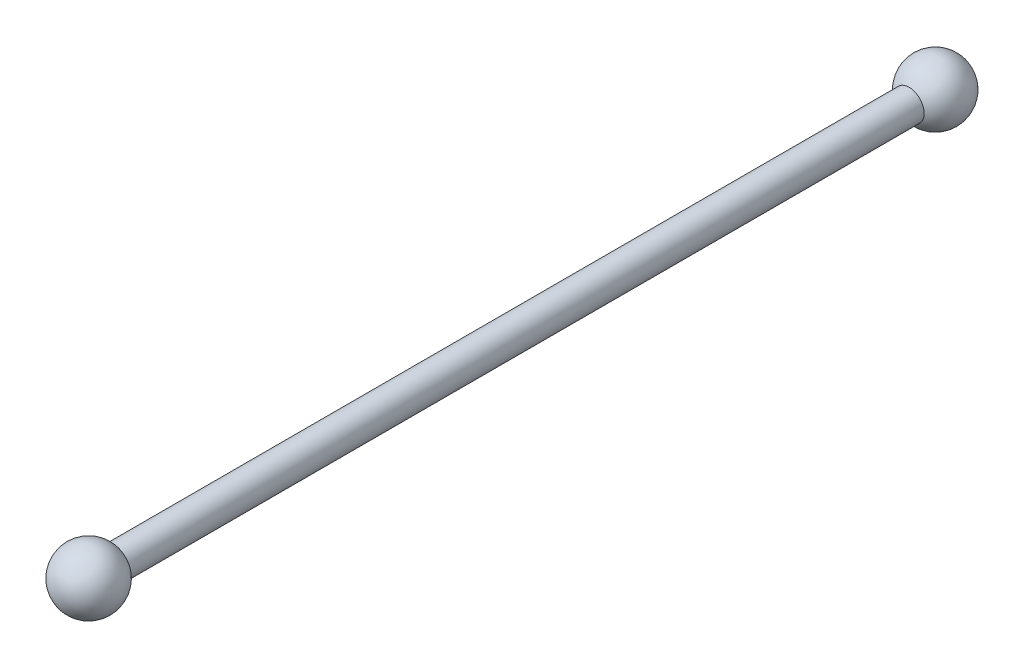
ISO-10303-21;
HEADER;
FILE_DESCRIPTION(('STEP AP214'),'2;1');
FILE_NAME('part.step','',(''),(''),'','','');
FILE_SCHEMA(('AUTOMOTIVE_DESIGN { 1 0 10303 214 1 1 1 1 }'));
ENDSEC;
DATA;
#1=APPLICATION_CONTEXT('core data for automotive mechanical design processes');
#2=APPLICATION_PROTOCOL_DEFINITION('international standard','automotive_design',2000,#1);
#3=PRODUCT_CONTEXT('',#1,'mechanical');
#4=PRODUCT('Part','Part','',(#3));
#5=PRODUCT_RELATED_PRODUCT_CATEGORY('part','',(#4));
#6=PRODUCT_DEFINITION_FORMATION('','',#4);
#7=PRODUCT_DEFINITION_CONTEXT('part definition',#1,'design');
#8=PRODUCT_DEFINITION('design','',#6,#7);
#9=PRODUCT_DEFINITION_SHAPE('','',#8);
#10=(LENGTH_UNIT() NAMED_UNIT(*) SI_UNIT(.MILLI.,.METRE.));
#11=(NAMED_UNIT(*) PLANE_ANGLE_UNIT() SI_UNIT($,.RADIAN.));
#12=(NAMED_UNIT(*) SI_UNIT($,.STERADIAN.) SOLID_ANGLE_UNIT());
#13=UNCERTAINTY_MEASURE_WITH_UNIT(LENGTH_MEASURE(1.E-05),#10,'distance_accuracy_value','');
#14=(GEOMETRIC_REPRESENTATION_CONTEXT(3) GLOBAL_UNCERTAINTY_ASSIGNED_CONTEXT((#13)) GLOBAL_UNIT_ASSIGNED_CONTEXT((#10,
#11,#12)) REPRESENTATION_CONTEXT('',''));
#15=CARTESIAN_POINT('',(0.,0.,0.));
#16=DIRECTION('',(0.,0.,1.));
#17=DIRECTION('',(1.,0.,0.));
#18=AXIS2_PLACEMENT_3D('',#15,#16,#17);
#19=CARTESIAN_POINT('',(0.,0.,700.));
#20=DIRECTION('',(0.,0.,-1.));
#21=DIRECTION('',(-1.,0.,0.));
#22=AXIS2_PLACEMENT_3D('',#19,#20,#21);
#23=CYLINDRICAL_SURFACE('',#22,25.);
#24=CARTESIAN_POINT('',(0.,0.,656.698729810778));
#25=DIRECTION('',(0.,0.,1.));
#26=DIRECTION('',(1.,0.,0.));
#27=AXIS2_PLACEMENT_3D('',#24,#25,#26);
#28=CIRCLE('',#27,25.);
#29=CARTESIAN_POINT('',(25.,0.,656.698729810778));
#30=VERTEX_POINT('',#29);
#31=EDGE_CURVE('E39',#30,#30,#28,.T.);
#32=ORIENTED_EDGE('',*,*,#31,.F.);
#33=EDGE_LOOP('',(#32));
#34=FACE_BOUND('',#33,.T.);
#35=CARTESIAN_POINT('',(0.,0.,-656.698729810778));
#36=DIRECTION('',(0.,0.,-1.));
#37=DIRECTION('',(-1.,0.,0.));
#38=AXIS2_PLACEMENT_3D('',#35,#36,#37);
#39=CIRCLE('',#38,25.);
#40=CARTESIAN_POINT('',(-25.,0.,-656.698729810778));
#41=VERTEX_POINT('',#40);
#42=EDGE_CURVE('E10',#41,#41,#39,.T.);
#43=ORIENTED_EDGE('',*,*,#42,.F.);
#44=EDGE_LOOP('',(#43));
#45=FACE_BOUND('',#44,.T.);
#46=ADVANCED_FACE('F32',(#34,#45),#23,.T.);
#47=CARTESIAN_POINT('',(0.,0.,700.));
#48=DIRECTION('',(0.,0.,-1.));
#49=DIRECTION('',(1.,0.,0.));
#50=AXIS2_PLACEMENT_3D('',#47,#48,#49);
#51=SPHERICAL_SURFACE('',#50,50.);
#52=ORIENTED_EDGE('',*,*,#31,.T.);
#53=EDGE_LOOP('',(#52));
#54=FACE_BOUND('',#53,.T.);
#55=ADVANCED_FACE('F45',(#54),#51,.T.);
#56=CARTESIAN_POINT('',(0.,0.,-700.));
#57=DIRECTION('',(0.,0.,1.));
#58=DIRECTION('',(1.,0.,0.));
#59=AXIS2_PLACEMENT_3D('',#56,#57,#58);
#60=SPHERICAL_SURFACE('',#59,50.);
#61=ORIENTED_EDGE('',*,*,#42,.T.);
#62=EDGE_LOOP('',(#61));
#63=FACE_BOUND('',#62,.T.);
#64=ADVANCED_FACE('F52',(#63),#60,.T.);
#65=CLOSED_SHELL('',(#46,#55,#64));
#66=MANIFOLD_SOLID_BREP('B2',#65);
#67=ADVANCED_BREP_SHAPE_REPRESENTATION('',(#18,#66),#14);
#68=SHAPE_DEFINITION_REPRESENTATION(#9,#67);
ENDSEC;
END-ISO-10303-21;
